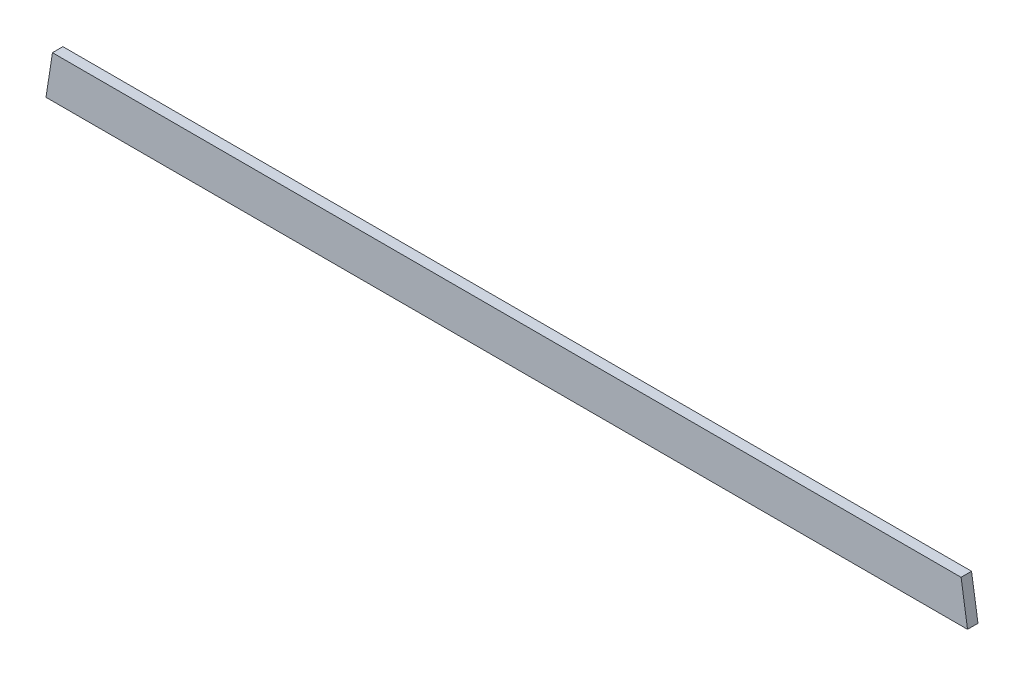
ISO-10303-21;
HEADER;
FILE_DESCRIPTION(('STEP AP214'),'2;1');
FILE_NAME('part.step','',(''),(''),'','','');
FILE_SCHEMA(('AUTOMOTIVE_DESIGN { 1 0 10303 214 1 1 1 1 }'));
ENDSEC;
DATA;
#1=APPLICATION_CONTEXT('core data for automotive mechanical design processes');
#2=APPLICATION_PROTOCOL_DEFINITION('international standard','automotive_design',2000,#1);
#3=PRODUCT_CONTEXT('',#1,'mechanical');
#4=PRODUCT('Part','Part','',(#3));
#5=PRODUCT_RELATED_PRODUCT_CATEGORY('part','',(#4));
#6=PRODUCT_DEFINITION_FORMATION('','',#4);
#7=PRODUCT_DEFINITION_CONTEXT('part definition',#1,'design');
#8=PRODUCT_DEFINITION('design','',#6,#7);
#9=PRODUCT_DEFINITION_SHAPE('','',#8);
#10=(LENGTH_UNIT() NAMED_UNIT(*) SI_UNIT(.MILLI.,.METRE.));
#11=(NAMED_UNIT(*) PLANE_ANGLE_UNIT() SI_UNIT($,.RADIAN.));
#12=(NAMED_UNIT(*) SI_UNIT($,.STERADIAN.) SOLID_ANGLE_UNIT());
#13=UNCERTAINTY_MEASURE_WITH_UNIT(LENGTH_MEASURE(1.E-05),#10,'distance_accuracy_value','');
#14=(GEOMETRIC_REPRESENTATION_CONTEXT(3) GLOBAL_UNCERTAINTY_ASSIGNED_CONTEXT((#13)) GLOBAL_UNIT_ASSIGNED_CONTEXT((#10,
#11,#12)) REPRESENTATION_CONTEXT('',''));
#15=CARTESIAN_POINT('',(0.,0.,0.));
#16=DIRECTION('',(0.,0.,1.));
#17=DIRECTION('',(1.,0.,0.));
#18=AXIS2_PLACEMENT_3D('',#15,#16,#17);
#19=CARTESIAN_POINT('',(-1101.96923076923,-1270.,25.4));
#20=DIRECTION('',(0.988371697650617,-0.152057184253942,0.));
#21=DIRECTION('',(0.152057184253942,0.988371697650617,0.));
#22=AXIS2_PLACEMENT_3D('',#19,#20,#21);
#23=PLANE('',#22);
#24=DIRECTION('',(-0.152057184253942,-0.988371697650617,0.));
#25=VECTOR('',#24,1.);
#26=CARTESIAN_POINT('',(-1101.96923076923,-1270.,0.));
#27=LINE('',#26,#25);
#28=CARTESIAN_POINT('',(-1101.96923076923,-1270.,0.));
#29=VERTEX_POINT('',#28);
#30=CARTESIAN_POINT('',(-1117.6,-1371.6,0.));
#31=VERTEX_POINT('',#30);
#32=EDGE_CURVE('E96',#29,#31,#27,.T.);
#33=ORIENTED_EDGE('',*,*,#32,.T.);
#34=DIRECTION('',(0.,0.,-1.));
#35=VECTOR('',#34,1.);
#36=CARTESIAN_POINT('',(-1117.6,-1371.6,25.4));
#37=LINE('',#36,#35);
#38=CARTESIAN_POINT('',(-1117.6,-1371.6,25.4));
#39=VERTEX_POINT('',#38);
#40=EDGE_CURVE('E11',#39,#31,#37,.T.);
#41=ORIENTED_EDGE('',*,*,#40,.F.);
#42=DIRECTION('',(-0.152057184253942,-0.988371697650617,0.));
#43=VECTOR('',#42,1.);
#44=CARTESIAN_POINT('',(-1101.96923076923,-1270.,25.4));
#45=LINE('',#44,#43);
#46=CARTESIAN_POINT('',(-1101.96923076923,-1270.,25.4));
#47=VERTEX_POINT('',#46);
#48=EDGE_CURVE('E82',#47,#39,#45,.T.);
#49=ORIENTED_EDGE('',*,*,#48,.F.);
#50=DIRECTION('',(0.,0.,-1.));
#51=VECTOR('',#50,1.);
#52=CARTESIAN_POINT('',(-1101.96923076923,-1270.,25.4));
#53=LINE('',#52,#51);
#54=EDGE_CURVE('E49',#47,#29,#53,.T.);
#55=ORIENTED_EDGE('',*,*,#54,.T.);
#56=EDGE_LOOP('',(#33,#41,#49,#55));
#57=FACE_BOUND('',#56,.T.);
#58=ADVANCED_FACE('F33',(#57),#23,.F.);
#59=CARTESIAN_POINT('',(-1117.6,-1371.6,25.4));
#60=DIRECTION('',(0.,1.,0.));
#61=DIRECTION('',(0.,0.,1.));
#62=AXIS2_PLACEMENT_3D('',#59,#60,#61);
#63=PLANE('',#62);
#64=DIRECTION('',(1.,0.,0.));
#65=VECTOR('',#64,1.);
#66=CARTESIAN_POINT('',(-1117.6,-1371.6,0.));
#67=LINE('',#66,#65);
#68=CARTESIAN_POINT('',(1117.6,-1371.6,0.));
#69=VERTEX_POINT('',#68);
#70=EDGE_CURVE('E87',#31,#69,#67,.T.);
#71=ORIENTED_EDGE('',*,*,#70,.T.);
#72=DIRECTION('',(0.,0.,-1.));
#73=VECTOR('',#72,1.);
#74=CARTESIAN_POINT('',(1117.6,-1371.6,25.4));
#75=LINE('',#74,#73);
#76=CARTESIAN_POINT('',(1117.6,-1371.6,25.4));
#77=VERTEX_POINT('',#76);
#78=EDGE_CURVE('E41',#77,#69,#75,.T.);
#79=ORIENTED_EDGE('',*,*,#78,.F.);
#80=DIRECTION('',(1.,0.,0.));
#81=VECTOR('',#80,1.);
#82=CARTESIAN_POINT('',(-1117.6,-1371.6,25.4));
#83=LINE('',#82,#81);
#84=EDGE_CURVE('E75',#39,#77,#83,.T.);
#85=ORIENTED_EDGE('',*,*,#84,.F.);
#86=ORIENTED_EDGE('',*,*,#40,.T.);
#87=EDGE_LOOP('',(#71,#79,#85,#86));
#88=FACE_BOUND('',#87,.T.);
#89=ADVANCED_FACE('F86',(#88),#63,.F.);
#90=CARTESIAN_POINT('',(1117.6,-1371.6,25.4));
#91=DIRECTION('',(-0.988371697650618,-0.152057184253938,0.));
#92=DIRECTION('',(0.152057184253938,-0.988371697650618,0.));
#93=AXIS2_PLACEMENT_3D('',#90,#91,#92);
#94=PLANE('',#93);
#95=DIRECTION('',(-0.152057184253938,0.988371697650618,0.));
#96=VECTOR('',#95,1.);
#97=CARTESIAN_POINT('',(1117.6,-1371.6,0.));
#98=LINE('',#97,#96);
#99=CARTESIAN_POINT('',(1101.96923076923,-1270.,0.));
#100=VERTEX_POINT('',#99);
#101=EDGE_CURVE('E99',#69,#100,#98,.T.);
#102=ORIENTED_EDGE('',*,*,#101,.T.);
#103=DIRECTION('',(0.,0.,-1.));
#104=VECTOR('',#103,1.);
#105=CARTESIAN_POINT('',(1101.96923076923,-1270.,25.4));
#106=LINE('',#105,#104);
#107=CARTESIAN_POINT('',(1101.96923076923,-1270.,25.4));
#108=VERTEX_POINT('',#107);
#109=EDGE_CURVE('E64',#108,#100,#106,.T.);
#110=ORIENTED_EDGE('',*,*,#109,.F.);
#111=DIRECTION('',(-0.152057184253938,0.988371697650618,0.));
#112=VECTOR('',#111,1.);
#113=CARTESIAN_POINT('',(1117.6,-1371.6,25.4));
#114=LINE('',#113,#112);
#115=EDGE_CURVE('E81',#77,#108,#114,.T.);
#116=ORIENTED_EDGE('',*,*,#115,.F.);
#117=ORIENTED_EDGE('',*,*,#78,.T.);
#118=EDGE_LOOP('',(#102,#110,#116,#117));
#119=FACE_BOUND('',#118,.T.);
#120=ADVANCED_FACE('F90',(#119),#94,.F.);
#121=CARTESIAN_POINT('',(-1101.96923076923,-1270.,25.4));
#122=DIRECTION('',(0.,1.,0.));
#123=DIRECTION('',(0.,0.,1.));
#124=AXIS2_PLACEMENT_3D('',#121,#122,#123);
#125=PLANE('',#124);
#126=DIRECTION('',(1.,0.,0.));
#127=VECTOR('',#126,1.);
#128=CARTESIAN_POINT('',(-1101.96923076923,-1270.,0.));
#129=LINE('',#128,#127);
#130=EDGE_CURVE('E101',#29,#100,#129,.T.);
#131=ORIENTED_EDGE('',*,*,#130,.F.);
#132=ORIENTED_EDGE('',*,*,#54,.F.);
#133=DIRECTION('',(1.,0.,0.));
#134=VECTOR('',#133,1.);
#135=CARTESIAN_POINT('',(-1101.96923076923,-1270.,25.4));
#136=LINE('',#135,#134);
#137=EDGE_CURVE('E91',#47,#108,#136,.T.);
#138=ORIENTED_EDGE('',*,*,#137,.T.);
#139=ORIENTED_EDGE('',*,*,#109,.T.);
#140=EDGE_LOOP('',(#131,#132,#138,#139));
#141=FACE_BOUND('',#140,.T.);
#142=ADVANCED_FACE('F107',(#141),#125,.T.);
#143=CARTESIAN_POINT('',(0.,0.,25.4));
#144=DIRECTION('',(0.,0.,1.));
#145=DIRECTION('',(1.,0.,0.));
#146=AXIS2_PLACEMENT_3D('',#143,#144,#145);
#147=PLANE('',#146);
#148=ORIENTED_EDGE('',*,*,#48,.T.);
#149=ORIENTED_EDGE('',*,*,#84,.T.);
#150=ORIENTED_EDGE('',*,*,#115,.T.);
#151=ORIENTED_EDGE('',*,*,#137,.F.);
#152=EDGE_LOOP('',(#148,#149,#150,#151));
#153=FACE_BOUND('',#152,.T.);
#154=ADVANCED_FACE('F78',(#153),#147,.T.);
#155=CARTESIAN_POINT('',(0.,0.,0.));
#156=DIRECTION('',(0.,0.,1.));
#157=DIRECTION('',(1.,0.,0.));
#158=AXIS2_PLACEMENT_3D('',#155,#156,#157);
#159=PLANE('',#158);
#160=ORIENTED_EDGE('',*,*,#32,.F.);
#161=ORIENTED_EDGE('',*,*,#130,.T.);
#162=ORIENTED_EDGE('',*,*,#101,.F.);
#163=ORIENTED_EDGE('',*,*,#70,.F.);
#164=EDGE_LOOP('',(#160,#161,#162,#163));
#165=FACE_BOUND('',#164,.T.);
#166=ADVANCED_FACE('F106',(#165),#159,.F.);
#167=CLOSED_SHELL('',(#58,#89,#120,#142,#154,#166));
#168=MANIFOLD_SOLID_BREP('B2',#167);
#169=ADVANCED_BREP_SHAPE_REPRESENTATION('',(#18,#168),#14);
#170=SHAPE_DEFINITION_REPRESENTATION(#9,#169);
ENDSEC;
END-ISO-10303-21;
